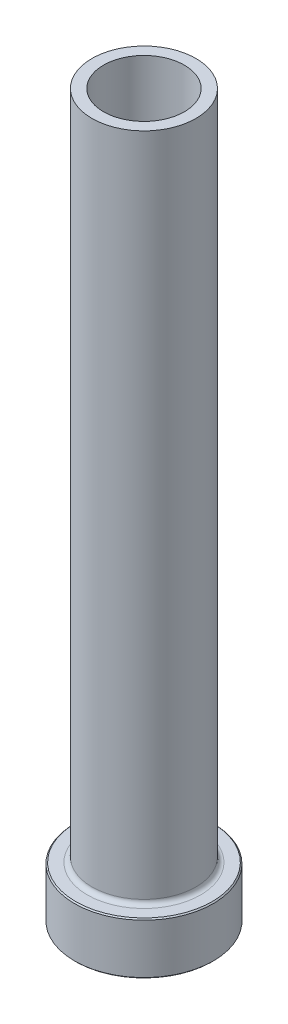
ISO-10303-21;
HEADER;
FILE_DESCRIPTION(('STEP AP214'),'2;1');
FILE_NAME('part.step','',(''),(''),'','','');
FILE_SCHEMA(('AUTOMOTIVE_DESIGN { 1 0 10303 214 1 1 1 1 }'));
ENDSEC;
DATA;
#1=APPLICATION_CONTEXT('core data for automotive mechanical design processes');
#2=APPLICATION_PROTOCOL_DEFINITION('international standard','automotive_design',2000,#1);
#3=PRODUCT_CONTEXT('',#1,'mechanical');
#4=PRODUCT('Part','Part','',(#3));
#5=PRODUCT_RELATED_PRODUCT_CATEGORY('part','',(#4));
#6=PRODUCT_DEFINITION_FORMATION('','',#4);
#7=PRODUCT_DEFINITION_CONTEXT('part definition',#1,'design');
#8=PRODUCT_DEFINITION('design','',#6,#7);
#9=PRODUCT_DEFINITION_SHAPE('','',#8);
#10=(LENGTH_UNIT() NAMED_UNIT(*) SI_UNIT(.MILLI.,.METRE.));
#11=(NAMED_UNIT(*) PLANE_ANGLE_UNIT() SI_UNIT($,.RADIAN.));
#12=(NAMED_UNIT(*) SI_UNIT($,.STERADIAN.) SOLID_ANGLE_UNIT());
#13=UNCERTAINTY_MEASURE_WITH_UNIT(LENGTH_MEASURE(1.E-05),#10,'distance_accuracy_value','');
#14=(GEOMETRIC_REPRESENTATION_CONTEXT(3) GLOBAL_UNCERTAINTY_ASSIGNED_CONTEXT((#13)) GLOBAL_UNIT_ASSIGNED_CONTEXT((#10,
#11,#12)) REPRESENTATION_CONTEXT('',''));
#15=CARTESIAN_POINT('',(0.,0.,0.));
#16=DIRECTION('',(0.,0.,1.));
#17=DIRECTION('',(1.,0.,0.));
#18=AXIS2_PLACEMENT_3D('',#15,#16,#17);
#19=CARTESIAN_POINT('',(0.,92.1876809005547,0.));
#20=DIRECTION('',(0.,1.,0.));
#21=DIRECTION('',(0.,0.,1.));
#22=AXIS2_PLACEMENT_3D('',#19,#20,#21);
#23=CYLINDRICAL_SURFACE('',#22,6.99999999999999);
#24=CARTESIAN_POINT('',(0.,125.,0.));
#25=DIRECTION('',(0.,1.,0.));
#26=DIRECTION('',(0.,0.,1.));
#27=AXIS2_PLACEMENT_3D('',#24,#25,#26);
#28=CIRCLE('',#27,6.99999999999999);
#29=CARTESIAN_POINT('',(0.,125.,6.99999999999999));
#30=VERTEX_POINT('',#29);
#31=EDGE_CURVE('E62',#30,#30,#28,.T.);
#32=ORIENTED_EDGE('',*,*,#31,.T.);
#33=EDGE_LOOP('',(#32));
#34=FACE_BOUND('',#33,.T.);
#35=CARTESIAN_POINT('',(0.,70.,0.));
#36=DIRECTION('',(0.,1.,0.));
#37=DIRECTION('',(0.,0.,1.));
#38=AXIS2_PLACEMENT_3D('',#35,#36,#37);
#39=CIRCLE('',#38,6.99999999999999);
#40=CARTESIAN_POINT('',(0.,70.,6.99999999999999));
#41=VERTEX_POINT('',#40);
#42=EDGE_CURVE('E71',#41,#41,#39,.T.);
#43=ORIENTED_EDGE('',*,*,#42,.F.);
#44=EDGE_LOOP('',(#43));
#45=FACE_BOUND('',#44,.T.);
#46=ADVANCED_FACE('F30',(#34,#45),#23,.F.);
#47=CARTESIAN_POINT('',(-6.99999999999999,125.,0.));
#48=DIRECTION('',(0.,1.,0.));
#49=DIRECTION('',(0.,0.,1.));
#50=AXIS2_PLACEMENT_3D('',#47,#48,#49);
#51=PLANE('',#50);
#52=CARTESIAN_POINT('',(0.,125.,0.));
#53=DIRECTION('',(0.,1.,0.));
#54=DIRECTION('',(0.,0.,1.));
#55=AXIS2_PLACEMENT_3D('',#52,#53,#54);
#56=CIRCLE('',#55,9.);
#57=CARTESIAN_POINT('',(0.,125.,9.));
#58=VERTEX_POINT('',#57);
#59=EDGE_CURVE('E65',#58,#58,#56,.T.);
#60=ORIENTED_EDGE('',*,*,#59,.T.);
#61=EDGE_LOOP('',(#60));
#62=FACE_BOUND('',#61,.T.);
#63=ORIENTED_EDGE('',*,*,#31,.F.);
#64=EDGE_LOOP('',(#63));
#65=FACE_BOUND('',#64,.T.);
#66=ADVANCED_FACE('F79',(#62,#65),#51,.T.);
#67=CARTESIAN_POINT('',(0.,92.1876809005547,0.));
#68=DIRECTION('',(0.,1.,0.));
#69=DIRECTION('',(0.,0.,1.));
#70=AXIS2_PLACEMENT_3D('',#67,#68,#69);
#71=CYLINDRICAL_SURFACE('',#70,8.99999999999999);
#72=CARTESIAN_POINT('',(0.,9.8,0.));
#73=DIRECTION('',(0.,1.,0.));
#74=DIRECTION('',(0.,0.,1.));
#75=AXIS2_PLACEMENT_3D('',#72,#73,#74);
#76=CIRCLE('',#75,8.99999999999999);
#77=CARTESIAN_POINT('',(0.,9.8,8.99999999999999));
#78=VERTEX_POINT('',#77);
#79=EDGE_CURVE('E59',#78,#78,#76,.T.);
#80=ORIENTED_EDGE('',*,*,#79,.T.);
#81=EDGE_LOOP('',(#80));
#82=FACE_BOUND('',#81,.T.);
#83=ORIENTED_EDGE('',*,*,#59,.F.);
#84=EDGE_LOOP('',(#83));
#85=FACE_BOUND('',#84,.T.);
#86=ADVANCED_FACE('F85',(#82,#85),#71,.T.);
#87=CARTESIAN_POINT('',(-8.99999999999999,9.,0.));
#88=DIRECTION('',(0.,1.,0.));
#89=DIRECTION('',(0.,0.,1.));
#90=AXIS2_PLACEMENT_3D('',#87,#88,#89);
#91=PLANE('',#90);
#92=CARTESIAN_POINT('',(0.,9.,0.));
#93=DIRECTION('',(0.,1.,0.));
#94=DIRECTION('',(0.,0.,1.));
#95=AXIS2_PLACEMENT_3D('',#92,#93,#94);
#96=CIRCLE('',#95,11.8);
#97=CARTESIAN_POINT('',(0.,9.,11.8));
#98=VERTEX_POINT('',#97);
#99=EDGE_CURVE('E53',#98,#98,#96,.T.);
#100=ORIENTED_EDGE('',*,*,#99,.T.);
#101=EDGE_LOOP('',(#100));
#102=FACE_BOUND('',#101,.T.);
#103=CARTESIAN_POINT('',(0.,9.,0.));
#104=DIRECTION('',(0.,1.,0.));
#105=DIRECTION('',(0.,0.,1.));
#106=AXIS2_PLACEMENT_3D('',#103,#104,#105);
#107=CIRCLE('',#106,9.79999999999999);
#108=CARTESIAN_POINT('',(0.,9.,9.79999999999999));
#109=VERTEX_POINT('',#108);
#110=EDGE_CURVE('E56',#109,#109,#107,.F.);
#111=ORIENTED_EDGE('',*,*,#110,.T.);
#112=EDGE_LOOP('',(#111));
#113=FACE_BOUND('',#112,.T.);
#114=ADVANCED_FACE('F111',(#102,#113),#91,.T.);
#115=CARTESIAN_POINT('',(0.,92.1876809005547,0.));
#116=DIRECTION('',(0.,1.,0.));
#117=DIRECTION('',(0.,0.,1.));
#118=AXIS2_PLACEMENT_3D('',#115,#116,#117);
#119=CYLINDRICAL_SURFACE('',#118,12.);
#120=CARTESIAN_POINT('',(0.,8.8,0.));
#121=DIRECTION('',(0.,1.,0.));
#122=DIRECTION('',(0.,0.,1.));
#123=AXIS2_PLACEMENT_3D('',#120,#121,#122);
#124=CIRCLE('',#123,12.);
#125=CARTESIAN_POINT('',(0.,8.8,12.));
#126=VERTEX_POINT('',#125);
#127=EDGE_CURVE('E45',#126,#126,#124,.F.);
#128=ORIENTED_EDGE('',*,*,#127,.T.);
#129=EDGE_LOOP('',(#128));
#130=FACE_BOUND('',#129,.T.);
#131=CARTESIAN_POINT('',(0.,0.200000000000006,0.));
#132=DIRECTION('',(0.,-1.,0.));
#133=DIRECTION('',(0.,0.,-1.));
#134=AXIS2_PLACEMENT_3D('',#131,#132,#133);
#135=CIRCLE('',#134,12.);
#136=CARTESIAN_POINT('',(0.,0.200000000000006,-12.));
#137=VERTEX_POINT('',#136);
#138=EDGE_CURVE('E50',#137,#137,#135,.F.);
#139=ORIENTED_EDGE('',*,*,#138,.T.);
#140=EDGE_LOOP('',(#139));
#141=FACE_BOUND('',#140,.T.);
#142=ADVANCED_FACE('F108',(#130,#141),#119,.T.);
#143=CARTESIAN_POINT('',(-12.,0.,0.));
#144=DIRECTION('',(0.,-1.,0.));
#145=DIRECTION('',(0.,0.,-1.));
#146=AXIS2_PLACEMENT_3D('',#143,#144,#145);
#147=PLANE('',#146);
#148=CARTESIAN_POINT('',(0.,0.,0.));
#149=DIRECTION('',(0.,-1.,0.));
#150=DIRECTION('',(0.,0.,-1.));
#151=AXIS2_PLACEMENT_3D('',#148,#149,#150);
#152=CIRCLE('',#151,7.74999999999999);
#153=CARTESIAN_POINT('',(0.,0.,-7.74999999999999));
#154=VERTEX_POINT('',#153);
#155=EDGE_CURVE('E37',#154,#154,#152,.F.);
#156=ORIENTED_EDGE('',*,*,#155,.T.);
#157=EDGE_LOOP('',(#156));
#158=FACE_BOUND('',#157,.T.);
#159=CARTESIAN_POINT('',(0.,0.,0.));
#160=DIRECTION('',(0.,-1.,0.));
#161=DIRECTION('',(0.,0.,-1.));
#162=AXIS2_PLACEMENT_3D('',#159,#160,#161);
#163=CIRCLE('',#162,11.8);
#164=CARTESIAN_POINT('',(0.,0.,-11.8));
#165=VERTEX_POINT('',#164);
#166=EDGE_CURVE('E41',#165,#165,#163,.T.);
#167=ORIENTED_EDGE('',*,*,#166,.T.);
#168=EDGE_LOOP('',(#167));
#169=FACE_BOUND('',#168,.T.);
#170=ADVANCED_FACE('F110',(#158,#169),#147,.T.);
#171=CARTESIAN_POINT('',(0.,92.1876809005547,0.));
#172=DIRECTION('',(0.,1.,0.));
#173=DIRECTION('',(0.,0.,1.));
#174=AXIS2_PLACEMENT_3D('',#171,#172,#173);
#175=CYLINDRICAL_SURFACE('',#174,7.24999999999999);
#176=CARTESIAN_POINT('',(0.,0.5,0.));
#177=DIRECTION('',(0.,-1.,0.));
#178=DIRECTION('',(0.,0.,-1.));
#179=AXIS2_PLACEMENT_3D('',#176,#177,#178);
#180=CIRCLE('',#179,7.24999999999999);
#181=CARTESIAN_POINT('',(0.,0.5,-7.24999999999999));
#182=VERTEX_POINT('',#181);
#183=EDGE_CURVE('E10',#182,#182,#180,.T.);
#184=ORIENTED_EDGE('',*,*,#183,.T.);
#185=EDGE_LOOP('',(#184));
#186=FACE_BOUND('',#185,.T.);
#187=CARTESIAN_POINT('',(0.,58.,0.));
#188=DIRECTION('',(0.,1.,0.));
#189=DIRECTION('',(0.,0.,1.));
#190=AXIS2_PLACEMENT_3D('',#187,#188,#189);
#191=CIRCLE('',#190,7.25);
#192=CARTESIAN_POINT('',(0.,58.,7.25));
#193=VERTEX_POINT('',#192);
#194=EDGE_CURVE('E68',#193,#193,#191,.T.);
#195=ORIENTED_EDGE('',*,*,#194,.T.);
#196=EDGE_LOOP('',(#195));
#197=FACE_BOUND('',#196,.T.);
#198=ADVANCED_FACE('F118',(#186,#197),#175,.F.);
#199=CARTESIAN_POINT('',(0.,58.,0.));
#200=DIRECTION('',(0.,-1.,0.));
#201=DIRECTION('',(0.,0.,-1.));
#202=AXIS2_PLACEMENT_3D('',#199,#200,#201);
#203=CONICAL_SURFACE('',#202,7.25,0.0208303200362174);
#204=ORIENTED_EDGE('',*,*,#42,.T.);
#205=EDGE_LOOP('',(#204));
#206=FACE_BOUND('',#205,.T.);
#207=ORIENTED_EDGE('',*,*,#194,.F.);
#208=EDGE_LOOP('',(#207));
#209=FACE_BOUND('',#208,.T.);
#210=ADVANCED_FACE('F75',(#206,#209),#203,.F.);
#211=CARTESIAN_POINT('',(0.,9.8,0.));
#212=DIRECTION('',(0.,1.,0.));
#213=DIRECTION('',(0.,0.,1.));
#214=AXIS2_PLACEMENT_3D('',#211,#212,#213);
#215=TOROIDAL_SURFACE('',#214,9.79999999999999,0.8);
#216=ORIENTED_EDGE('',*,*,#110,.F.);
#217=EDGE_LOOP('',(#216));
#218=FACE_BOUND('',#217,.T.);
#219=ORIENTED_EDGE('',*,*,#79,.F.);
#220=EDGE_LOOP('',(#219));
#221=FACE_BOUND('',#220,.T.);
#222=ADVANCED_FACE('F90',(#218,#221),#215,.F.);
#223=CARTESIAN_POINT('',(0.,9.00000000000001,0.));
#224=DIRECTION('',(0.,-1.,0.));
#225=DIRECTION('',(0.,0.,-1.));
#226=AXIS2_PLACEMENT_3D('',#223,#224,#225);
#227=CONICAL_SURFACE('',#226,11.8,0.785398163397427);
#228=ORIENTED_EDGE('',*,*,#127,.F.);
#229=EDGE_LOOP('',(#228));
#230=FACE_BOUND('',#229,.T.);
#231=ORIENTED_EDGE('',*,*,#99,.F.);
#232=EDGE_LOOP('',(#231));
#233=FACE_BOUND('',#232,.T.);
#234=ADVANCED_FACE('F93',(#230,#233),#227,.T.);
#235=CARTESIAN_POINT('',(0.,0.200000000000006,0.));
#236=DIRECTION('',(0.,1.,0.));
#237=DIRECTION('',(0.,0.,1.));
#238=AXIS2_PLACEMENT_3D('',#235,#236,#237);
#239=CONICAL_SURFACE('',#238,12.,0.785398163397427);
#240=ORIENTED_EDGE('',*,*,#166,.F.);
#241=EDGE_LOOP('',(#240));
#242=FACE_BOUND('',#241,.T.);
#243=ORIENTED_EDGE('',*,*,#138,.F.);
#244=EDGE_LOOP('',(#243));
#245=FACE_BOUND('',#244,.T.);
#246=ADVANCED_FACE('F96',(#242,#245),#239,.T.);
#247=CARTESIAN_POINT('',(0.,0.,0.));
#248=DIRECTION('',(0.,-1.,0.));
#249=DIRECTION('',(0.,0.,-1.));
#250=AXIS2_PLACEMENT_3D('',#247,#248,#249);
#251=CONICAL_SURFACE('',#250,7.74999999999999,0.785398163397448);
#252=ORIENTED_EDGE('',*,*,#183,.F.);
#253=EDGE_LOOP('',(#252));
#254=FACE_BOUND('',#253,.T.);
#255=ORIENTED_EDGE('',*,*,#155,.F.);
#256=EDGE_LOOP('',(#255));
#257=FACE_BOUND('',#256,.T.);
#258=ADVANCED_FACE('F32',(#254,#257),#251,.F.);
#259=CLOSED_SHELL('',(#46,#66,#86,#114,#142,#170,#198,#210,#222,#234,#246,#258));
#260=MANIFOLD_SOLID_BREP('B2',#259);
#261=ADVANCED_BREP_SHAPE_REPRESENTATION('',(#18,#260),#14);
#262=SHAPE_DEFINITION_REPRESENTATION(#9,#261);
ENDSEC;
END-ISO-10303-21;
